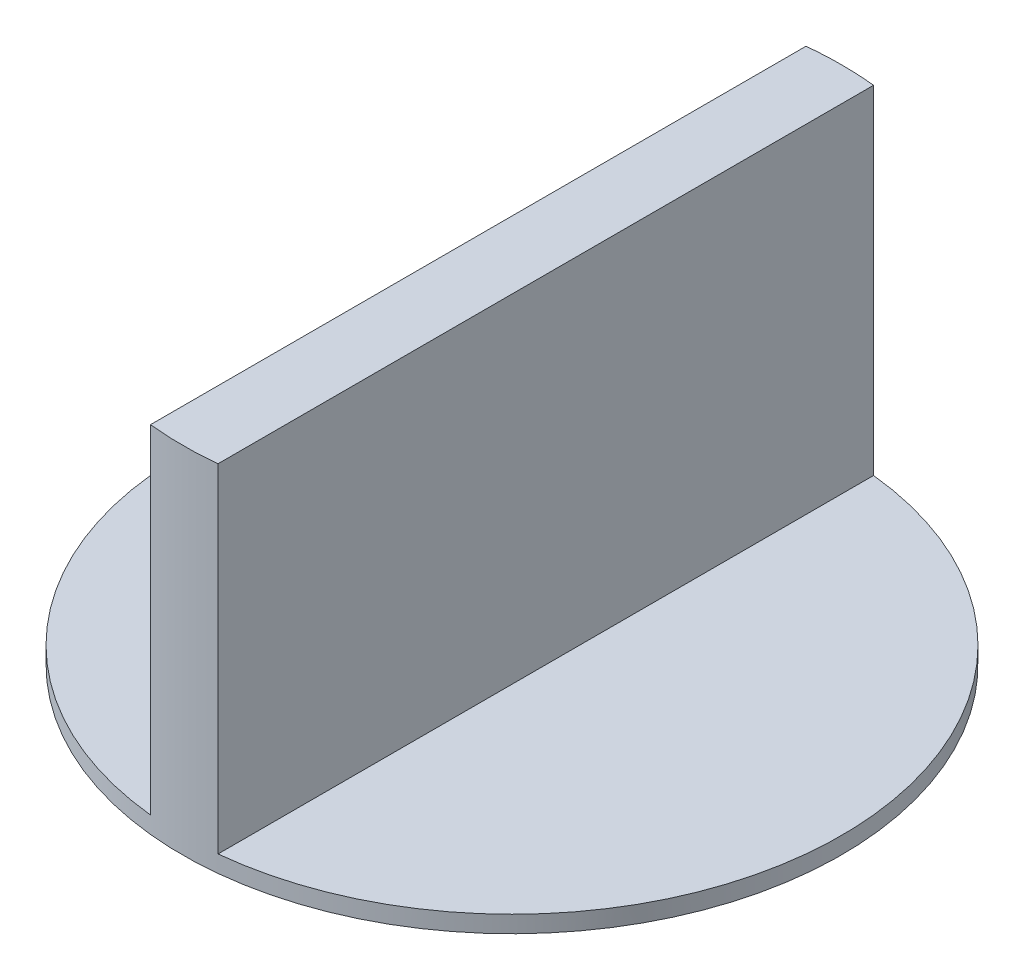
ISO-10303-21;
HEADER;
FILE_DESCRIPTION(('STEP AP214'),'2;1');
FILE_NAME('part.step','',(''),(''),'','','');
FILE_SCHEMA(('AUTOMOTIVE_DESIGN { 1 0 10303 214 1 1 1 1 }'));
ENDSEC;
DATA;
#1=APPLICATION_CONTEXT('core data for automotive mechanical design processes');
#2=APPLICATION_PROTOCOL_DEFINITION('international standard','automotive_design',2000,#1);
#3=PRODUCT_CONTEXT('',#1,'mechanical');
#4=PRODUCT('Part','Part','',(#3));
#5=PRODUCT_RELATED_PRODUCT_CATEGORY('part','',(#4));
#6=PRODUCT_DEFINITION_FORMATION('','',#4);
#7=PRODUCT_DEFINITION_CONTEXT('part definition',#1,'design');
#8=PRODUCT_DEFINITION('design','',#6,#7);
#9=PRODUCT_DEFINITION_SHAPE('','',#8);
#10=(LENGTH_UNIT() NAMED_UNIT(*) SI_UNIT(.MILLI.,.METRE.));
#11=(NAMED_UNIT(*) PLANE_ANGLE_UNIT() SI_UNIT($,.RADIAN.));
#12=(NAMED_UNIT(*) SI_UNIT($,.STERADIAN.) SOLID_ANGLE_UNIT());
#13=UNCERTAINTY_MEASURE_WITH_UNIT(LENGTH_MEASURE(1.E-05),#10,'distance_accuracy_value','');
#14=(GEOMETRIC_REPRESENTATION_CONTEXT(3) GLOBAL_UNCERTAINTY_ASSIGNED_CONTEXT((#13)) GLOBAL_UNIT_ASSIGNED_CONTEXT((#10,
#11,#12)) REPRESENTATION_CONTEXT('',''));
#15=CARTESIAN_POINT('',(0.,0.,0.));
#16=DIRECTION('',(0.,0.,1.));
#17=DIRECTION('',(1.,0.,0.));
#18=AXIS2_PLACEMENT_3D('',#15,#16,#17);
#19=CARTESIAN_POINT('',(0.2,77.9275030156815,-1.));
#20=DIRECTION('',(0.,-1.,0.));
#21=DIRECTION('',(0.,0.,-1.));
#22=AXIS2_PLACEMENT_3D('',#19,#20,#21);
#23=PLANE('',#22);
#24=CARTESIAN_POINT('',(0.,77.9275030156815,0.));
#25=DIRECTION('',(0.,-1.,0.));
#26=DIRECTION('',(0.,0.,-1.));
#27=AXIS2_PLACEMENT_3D('',#24,#25,#26);
#28=CIRCLE('',#27,1.95);
#29=CARTESIAN_POINT('',(0.2,77.9275030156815,1.93971647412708));
#30=VERTEX_POINT('',#29);
#31=CARTESIAN_POINT('',(-0.2,77.9275030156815,1.93971647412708));
#32=VERTEX_POINT('',#31);
#33=EDGE_CURVE('E72',#30,#32,#28,.T.);
#34=ORIENTED_EDGE('',*,*,#33,.F.);
#35=DIRECTION('',(0.,0.,-1.));
#36=VECTOR('',#35,1.);
#37=CARTESIAN_POINT('',(0.2,77.9275030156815,1.));
#38=LINE('',#37,#36);
#39=CARTESIAN_POINT('',(0.2,77.9275030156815,-1.93971647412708));
#40=VERTEX_POINT('',#39);
#41=EDGE_CURVE('E81',#40,#30,#38,.F.);
#42=ORIENTED_EDGE('',*,*,#41,.F.);
#43=CARTESIAN_POINT('',(0.,77.9275030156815,0.));
#44=DIRECTION('',(0.,-1.,0.));
#45=DIRECTION('',(0.,0.,-1.));
#46=AXIS2_PLACEMENT_3D('',#43,#44,#45);
#47=CIRCLE('',#46,1.95);
#48=CARTESIAN_POINT('',(-0.2,77.9275030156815,-1.93971647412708));
#49=VERTEX_POINT('',#48);
#50=EDGE_CURVE('E20',#49,#40,#47,.T.);
#51=ORIENTED_EDGE('',*,*,#50,.F.);
#52=DIRECTION('',(0.,0.,-1.));
#53=VECTOR('',#52,1.);
#54=CARTESIAN_POINT('',(-0.2,77.9275030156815,1.));
#55=LINE('',#54,#53);
#56=EDGE_CURVE('E67',#49,#32,#55,.F.);
#57=ORIENTED_EDGE('',*,*,#56,.T.);
#58=EDGE_LOOP('',(#34,#42,#51,#57));
#59=FACE_BOUND('',#58,.T.);
#60=ADVANCED_FACE('F17',(#59),#23,.F.);
#61=CARTESIAN_POINT('',(0.,75.9275030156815,0.));
#62=DIRECTION('',(0.,1.,0.));
#63=DIRECTION('',(0.,0.,1.));
#64=AXIS2_PLACEMENT_3D('',#61,#62,#63);
#65=PLANE('',#64);
#66=CARTESIAN_POINT('',(0.,75.9275030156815,0.));
#67=DIRECTION('',(0.,-1.,0.));
#68=DIRECTION('',(0.,0.,-1.));
#69=AXIS2_PLACEMENT_3D('',#66,#67,#68);
#70=CIRCLE('',#69,1.95);
#71=CARTESIAN_POINT('',(0.2,75.9275030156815,-1.93971647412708));
#72=VERTEX_POINT('',#71);
#73=CARTESIAN_POINT('',(0.2,75.9275030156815,1.93971647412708));
#74=VERTEX_POINT('',#73);
#75=EDGE_CURVE('E80',#72,#74,#70,.T.);
#76=ORIENTED_EDGE('',*,*,#75,.F.);
#77=DIRECTION('',(0.,0.,-1.));
#78=VECTOR('',#77,1.);
#79=CARTESIAN_POINT('',(0.2,75.9275030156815,1.));
#80=LINE('',#79,#78);
#81=EDGE_CURVE('E66',#74,#72,#80,.T.);
#82=ORIENTED_EDGE('',*,*,#81,.F.);
#83=EDGE_LOOP('',(#76,#82));
#84=FACE_BOUND('',#83,.T.);
#85=ADVANCED_FACE('F94',(#84),#65,.T.);
#86=CARTESIAN_POINT('',(0.,75.9275030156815,0.));
#87=DIRECTION('',(0.,1.,0.));
#88=DIRECTION('',(0.,0.,1.));
#89=AXIS2_PLACEMENT_3D('',#86,#87,#88);
#90=PLANE('',#89);
#91=DIRECTION('',(0.,0.,-1.));
#92=VECTOR('',#91,1.);
#93=CARTESIAN_POINT('',(-0.2,75.9275030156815,1.));
#94=LINE('',#93,#92);
#95=CARTESIAN_POINT('',(-0.2,75.9275030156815,1.93971647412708));
#96=VERTEX_POINT('',#95);
#97=CARTESIAN_POINT('',(-0.2,75.9275030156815,-1.93971647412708));
#98=VERTEX_POINT('',#97);
#99=EDGE_CURVE('E59',#96,#98,#94,.T.);
#100=ORIENTED_EDGE('',*,*,#99,.T.);
#101=CARTESIAN_POINT('',(0.,75.9275030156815,0.));
#102=DIRECTION('',(0.,-1.,0.));
#103=DIRECTION('',(0.,0.,-1.));
#104=AXIS2_PLACEMENT_3D('',#101,#102,#103);
#105=CIRCLE('',#104,1.95);
#106=EDGE_CURVE('E70',#96,#98,#105,.T.);
#107=ORIENTED_EDGE('',*,*,#106,.F.);
#108=EDGE_LOOP('',(#100,#107));
#109=FACE_BOUND('',#108,.T.);
#110=ADVANCED_FACE('F75',(#109),#90,.T.);
#111=CARTESIAN_POINT('',(-0.2,75.8275030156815,1.));
#112=DIRECTION('',(1.,0.,0.));
#113=DIRECTION('',(0.,0.,-1.));
#114=AXIS2_PLACEMENT_3D('',#111,#112,#113);
#115=PLANE('',#114);
#116=ORIENTED_EDGE('',*,*,#99,.F.);
#117=DIRECTION('',(0.,-1.,0.));
#118=VECTOR('',#117,1.);
#119=CARTESIAN_POINT('',(-0.2,79.5275030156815,1.93971647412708));
#120=LINE('',#119,#118);
#121=EDGE_CURVE('E62',#32,#96,#120,.T.);
#122=ORIENTED_EDGE('',*,*,#121,.F.);
#123=ORIENTED_EDGE('',*,*,#56,.F.);
#124=DIRECTION('',(0.,-1.,0.));
#125=VECTOR('',#124,1.);
#126=CARTESIAN_POINT('',(-0.2,79.5275030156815,-1.93971647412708));
#127=LINE('',#126,#125);
#128=EDGE_CURVE('E63',#98,#49,#127,.F.);
#129=ORIENTED_EDGE('',*,*,#128,.F.);
#130=EDGE_LOOP('',(#116,#122,#123,#129));
#131=FACE_BOUND('',#130,.T.);
#132=ADVANCED_FACE('F61',(#131),#115,.F.);
#133=CARTESIAN_POINT('',(0.2,75.8275030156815,1.));
#134=DIRECTION('',(1.,0.,0.));
#135=DIRECTION('',(0.,0.,-1.));
#136=AXIS2_PLACEMENT_3D('',#133,#134,#135);
#137=PLANE('',#136);
#138=ORIENTED_EDGE('',*,*,#41,.T.);
#139=DIRECTION('',(0.,-1.,0.));
#140=VECTOR('',#139,1.);
#141=CARTESIAN_POINT('',(0.2,79.5275030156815,1.93971647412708));
#142=LINE('',#141,#140);
#143=EDGE_CURVE('E73',#74,#30,#142,.F.);
#144=ORIENTED_EDGE('',*,*,#143,.F.);
#145=ORIENTED_EDGE('',*,*,#81,.T.);
#146=DIRECTION('',(0.,-1.,0.));
#147=VECTOR('',#146,1.);
#148=CARTESIAN_POINT('',(0.199999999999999,79.5275030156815,-1.93971647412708));
#149=LINE('',#148,#147);
#150=EDGE_CURVE('E25',#40,#72,#149,.T.);
#151=ORIENTED_EDGE('',*,*,#150,.F.);
#152=EDGE_LOOP('',(#138,#144,#145,#151));
#153=FACE_BOUND('',#152,.T.);
#154=ADVANCED_FACE('F90',(#153),#137,.T.);
#155=CARTESIAN_POINT('',(0.,79.5275030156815,0.));
#156=DIRECTION('',(0.,-1.,0.));
#157=DIRECTION('',(0.,0.,-1.));
#158=AXIS2_PLACEMENT_3D('',#155,#156,#157);
#159=CYLINDRICAL_SURFACE('',#158,1.95);
#160=CARTESIAN_POINT('',(0.,75.8275030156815,0.));
#161=DIRECTION('',(0.,-1.,0.));
#162=DIRECTION('',(0.,0.,-1.));
#163=AXIS2_PLACEMENT_3D('',#160,#161,#162);
#164=CIRCLE('',#163,1.95);
#165=CARTESIAN_POINT('',(0.,75.8275030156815,-1.95));
#166=VERTEX_POINT('',#165);
#167=EDGE_CURVE('E11',#166,#166,#164,.F.);
#168=ORIENTED_EDGE('',*,*,#167,.T.);
#169=EDGE_LOOP('',(#168));
#170=FACE_BOUND('',#169,.T.);
#171=ORIENTED_EDGE('',*,*,#50,.T.);
#172=ORIENTED_EDGE('',*,*,#150,.T.);
#173=ORIENTED_EDGE('',*,*,#75,.T.);
#174=ORIENTED_EDGE('',*,*,#143,.T.);
#175=ORIENTED_EDGE('',*,*,#33,.T.);
#176=ORIENTED_EDGE('',*,*,#121,.T.);
#177=ORIENTED_EDGE('',*,*,#106,.T.);
#178=ORIENTED_EDGE('',*,*,#128,.T.);
#179=EDGE_LOOP('',(#171,#172,#173,#174,#175,#176,#177,#178));
#180=FACE_BOUND('',#179,.T.);
#181=ADVANCED_FACE('F69',(#170,#180),#159,.T.);
#182=CARTESIAN_POINT('',(0.,75.8275030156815,0.));
#183=DIRECTION('',(0.,1.,0.));
#184=DIRECTION('',(0.,0.,1.));
#185=AXIS2_PLACEMENT_3D('',#182,#183,#184);
#186=PLANE('',#185);
#187=ORIENTED_EDGE('',*,*,#167,.F.);
#188=EDGE_LOOP('',(#187));
#189=FACE_BOUND('',#188,.T.);
#190=ADVANCED_FACE('F102',(#189),#186,.F.);
#191=CLOSED_SHELL('',(#60,#85,#110,#132,#154,#181,#190));
#192=MANIFOLD_SOLID_BREP('B1',#191);
#193=ADVANCED_BREP_SHAPE_REPRESENTATION('',(#18,#192),#14);
#194=SHAPE_DEFINITION_REPRESENTATION(#9,#193);
ENDSEC;
END-ISO-10303-21;
